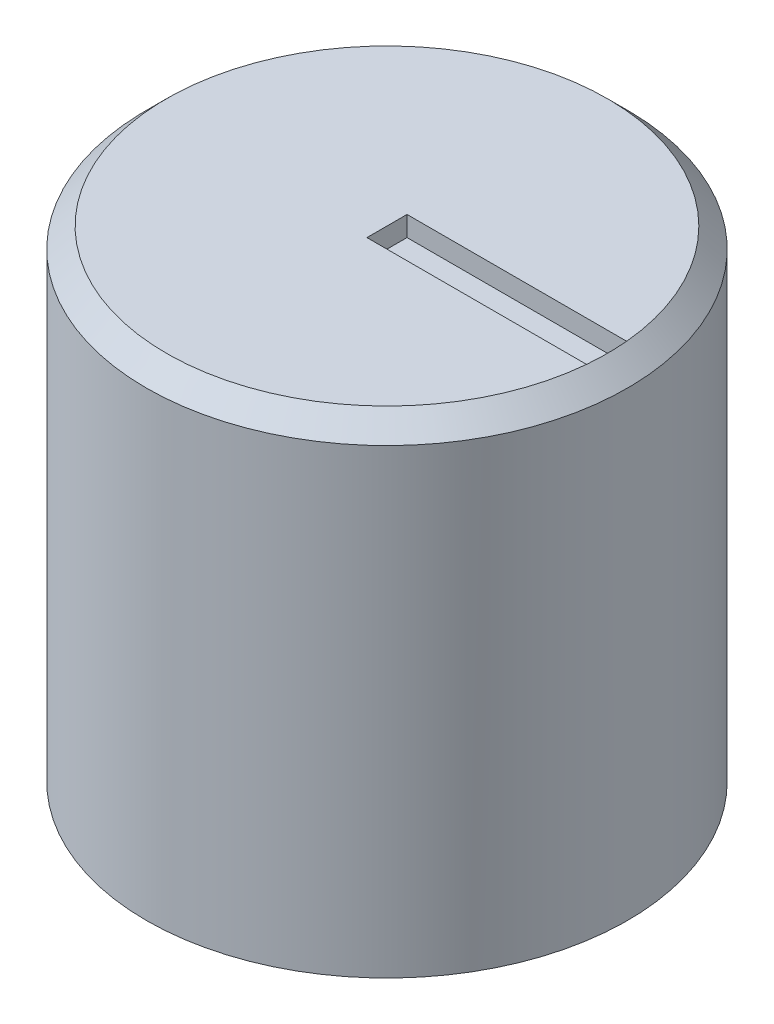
ISO-10303-21;
HEADER;
FILE_DESCRIPTION(('STEP AP214'),'2;1');
FILE_NAME('part.step','',(''),(''),'','','');
FILE_SCHEMA(('AUTOMOTIVE_DESIGN { 1 0 10303 214 1 1 1 1 }'));
ENDSEC;
DATA;
#1=APPLICATION_CONTEXT('core data for automotive mechanical design processes');
#2=APPLICATION_PROTOCOL_DEFINITION('international standard','automotive_design',2000,#1);
#3=PRODUCT_CONTEXT('',#1,'mechanical');
#4=PRODUCT('Part','Part','',(#3));
#5=PRODUCT_RELATED_PRODUCT_CATEGORY('part','',(#4));
#6=PRODUCT_DEFINITION_FORMATION('','',#4);
#7=PRODUCT_DEFINITION_CONTEXT('part definition',#1,'design');
#8=PRODUCT_DEFINITION('design','',#6,#7);
#9=PRODUCT_DEFINITION_SHAPE('','',#8);
#10=(LENGTH_UNIT() NAMED_UNIT(*) SI_UNIT(.MILLI.,.METRE.));
#11=(NAMED_UNIT(*) PLANE_ANGLE_UNIT() SI_UNIT($,.RADIAN.));
#12=(NAMED_UNIT(*) SI_UNIT($,.STERADIAN.) SOLID_ANGLE_UNIT());
#13=UNCERTAINTY_MEASURE_WITH_UNIT(LENGTH_MEASURE(1.E-05),#10,'distance_accuracy_value','');
#14=(GEOMETRIC_REPRESENTATION_CONTEXT(3) GLOBAL_UNCERTAINTY_ASSIGNED_CONTEXT((#13)) GLOBAL_UNIT_ASSIGNED_CONTEXT((#10,
#11,#12)) REPRESENTATION_CONTEXT('',''));
#15=CARTESIAN_POINT('',(0.,0.,0.));
#16=DIRECTION('',(0.,0.,1.));
#17=DIRECTION('',(1.,0.,0.));
#18=AXIS2_PLACEMENT_3D('',#15,#16,#17);
#19=CARTESIAN_POINT('',(0.,12.,0.));
#20=DIRECTION('',(0.,-1.,0.));
#21=DIRECTION('',(0.,0.,-1.));
#22=AXIS2_PLACEMENT_3D('',#19,#20,#21);
#23=CYLINDRICAL_SURFACE('',#22,6.);
#24=CARTESIAN_POINT('',(0.,11.5,0.));
#25=DIRECTION('',(0.,1.,0.));
#26=DIRECTION('',(0.,0.,1.));
#27=AXIS2_PLACEMENT_3D('',#24,#25,#26);
#28=CIRCLE('',#27,6.);
#29=CARTESIAN_POINT('',(0.,11.5,6.));
#30=VERTEX_POINT('',#29);
#31=EDGE_CURVE('E12',#30,#30,#28,.F.);
#32=ORIENTED_EDGE('',*,*,#31,.T.);
#33=EDGE_LOOP('',(#32));
#34=FACE_BOUND('',#33,.T.);
#35=CARTESIAN_POINT('',(0.,0.,0.));
#36=DIRECTION('',(0.,1.,0.));
#37=DIRECTION('',(0.,0.,1.));
#38=AXIS2_PLACEMENT_3D('',#35,#36,#37);
#39=CIRCLE('',#38,6.);
#40=CARTESIAN_POINT('',(0.,0.,6.));
#41=VERTEX_POINT('',#40);
#42=EDGE_CURVE('E122',#41,#41,#39,.T.);
#43=ORIENTED_EDGE('',*,*,#42,.T.);
#44=EDGE_LOOP('',(#43));
#45=FACE_BOUND('',#44,.T.);
#46=ADVANCED_FACE('F38',(#34,#45),#23,.T.);
#47=CARTESIAN_POINT('',(0.,12.,0.));
#48=DIRECTION('',(0.,1.,0.));
#49=DIRECTION('',(0.,0.,1.));
#50=AXIS2_PLACEMENT_3D('',#47,#48,#49);
#51=PLANE('',#50);
#52=DIRECTION('',(-1.,0.,0.));
#53=VECTOR('',#52,1.);
#54=CARTESIAN_POINT('',(0.,12.,-0.5));
#55=LINE('',#54,#53);
#56=CARTESIAN_POINT('',(5.47722557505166,12.,-0.5));
#57=VERTEX_POINT('',#56);
#58=CARTESIAN_POINT('',(0.,12.,-0.5));
#59=VERTEX_POINT('',#58);
#60=EDGE_CURVE('E102',#57,#59,#55,.T.);
#61=ORIENTED_EDGE('',*,*,#60,.F.);
#62=CARTESIAN_POINT('',(0.,12.,0.));
#63=DIRECTION('',(0.,1.,0.));
#64=DIRECTION('',(0.,0.,1.));
#65=AXIS2_PLACEMENT_3D('',#62,#63,#64);
#66=CIRCLE('',#65,5.5);
#67=CARTESIAN_POINT('',(5.47722557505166,12.,0.5));
#68=VERTEX_POINT('',#67);
#69=EDGE_CURVE('E133',#57,#68,#66,.T.);
#70=ORIENTED_EDGE('',*,*,#69,.T.);
#71=DIRECTION('',(1.,0.,0.));
#72=VECTOR('',#71,1.);
#73=CARTESIAN_POINT('',(0.,12.,0.5));
#74=LINE('',#73,#72);
#75=CARTESIAN_POINT('',(0.,12.,0.5));
#76=VERTEX_POINT('',#75);
#77=EDGE_CURVE('E53',#76,#68,#74,.T.);
#78=ORIENTED_EDGE('',*,*,#77,.F.);
#79=DIRECTION('',(0.,0.,1.));
#80=VECTOR('',#79,1.);
#81=CARTESIAN_POINT('',(0.,12.,-0.5));
#82=LINE('',#81,#80);
#83=EDGE_CURVE('E106',#59,#76,#82,.T.);
#84=ORIENTED_EDGE('',*,*,#83,.F.);
#85=EDGE_LOOP('',(#61,#70,#78,#84));
#86=FACE_BOUND('',#85,.T.);
#87=ADVANCED_FACE('F138',(#86),#51,.T.);
#88=CARTESIAN_POINT('',(0.,0.,0.));
#89=DIRECTION('',(0.,1.,0.));
#90=DIRECTION('',(0.,0.,1.));
#91=AXIS2_PLACEMENT_3D('',#88,#89,#90);
#92=PLANE('',#91);
#93=CARTESIAN_POINT('',(0.,0.,0.));
#94=DIRECTION('',(0.,-1.,0.));
#95=DIRECTION('',(0.,0.,-1.));
#96=AXIS2_PLACEMENT_3D('',#93,#94,#95);
#97=CIRCLE('',#96,5.5);
#98=CARTESIAN_POINT('',(0.,0.,-5.5));
#99=VERTEX_POINT('',#98);
#100=EDGE_CURVE('E119',#99,#99,#97,.T.);
#101=ORIENTED_EDGE('',*,*,#100,.F.);
#102=EDGE_LOOP('',(#101));
#103=FACE_BOUND('',#102,.T.);
#104=ORIENTED_EDGE('',*,*,#42,.F.);
#105=EDGE_LOOP('',(#104));
#106=FACE_BOUND('',#105,.T.);
#107=ADVANCED_FACE('F160',(#103,#106),#92,.F.);
#108=CARTESIAN_POINT('',(0.,10.5,0.));
#109=DIRECTION('',(0.,-1.,0.));
#110=DIRECTION('',(0.,0.,-1.));
#111=AXIS2_PLACEMENT_3D('',#108,#109,#110);
#112=CYLINDRICAL_SURFACE('',#111,5.5);
#113=CARTESIAN_POINT('',(0.,8.49999999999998,0.));
#114=DIRECTION('',(0.,-1.,0.));
#115=DIRECTION('',(0.,0.,-1.));
#116=AXIS2_PLACEMENT_3D('',#113,#114,#115);
#117=CIRCLE('',#116,5.5);
#118=CARTESIAN_POINT('',(0.,8.49999999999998,-5.5));
#119=VERTEX_POINT('',#118);
#120=EDGE_CURVE('E131',#119,#119,#117,.F.);
#121=CARTESIAN_POINT('',(0.,8.49999999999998,-5.5));
#122=CARTESIAN_POINT('',(0.,8.41145833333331,-5.5));
#123=CARTESIAN_POINT('',(0.,8.32291666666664,-5.5));
#124=CARTESIAN_POINT('',(0.,8.14583333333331,-5.5));
#125=CARTESIAN_POINT('',(0.,8.05729166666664,-5.5));
#126=CARTESIAN_POINT('',(0.,7.88020833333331,-5.5));
#127=CARTESIAN_POINT('',(0.,7.79166666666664,-5.5));
#128=CARTESIAN_POINT('',(0.,7.61458333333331,-5.5));
#129=CARTESIAN_POINT('',(0.,7.52604166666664,-5.5));
#130=CARTESIAN_POINT('',(0.,7.34895833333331,-5.5));
#131=CARTESIAN_POINT('',(0.,7.26041666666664,-5.5));
#132=CARTESIAN_POINT('',(0.,7.08333333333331,-5.5));
#133=CARTESIAN_POINT('',(0.,6.99479166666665,-5.5));
#134=CARTESIAN_POINT('',(0.,6.81770833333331,-5.5));
#135=CARTESIAN_POINT('',(0.,6.72916666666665,-5.5));
#136=CARTESIAN_POINT('',(0.,6.55208333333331,-5.5));
#137=CARTESIAN_POINT('',(0.,6.46354166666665,-5.5));
#138=CARTESIAN_POINT('',(0.,6.28645833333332,-5.5));
#139=CARTESIAN_POINT('',(0.,6.19791666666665,-5.5));
#140=CARTESIAN_POINT('',(0.,6.02083333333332,-5.5));
#141=CARTESIAN_POINT('',(0.,5.93229166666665,-5.5));
#142=CARTESIAN_POINT('',(0.,5.75520833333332,-5.5));
#143=CARTESIAN_POINT('',(0.,5.66666666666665,-5.5));
#144=CARTESIAN_POINT('',(0.,5.48958333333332,-5.5));
#145=CARTESIAN_POINT('',(0.,5.40104166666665,-5.5));
#146=CARTESIAN_POINT('',(0.,5.22395833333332,-5.5));
#147=CARTESIAN_POINT('',(0.,5.13541666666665,-5.5));
#148=CARTESIAN_POINT('',(0.,4.95833333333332,-5.5));
#149=CARTESIAN_POINT('',(0.,4.86979166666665,-5.5));
#150=CARTESIAN_POINT('',(0.,4.69270833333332,-5.5));
#151=CARTESIAN_POINT('',(0.,4.60416666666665,-5.5));
#152=CARTESIAN_POINT('',(0.,4.42708333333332,-5.5));
#153=CARTESIAN_POINT('',(0.,4.33854166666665,-5.5));
#154=CARTESIAN_POINT('',(0.,4.16145833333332,-5.5));
#155=CARTESIAN_POINT('',(0.,4.07291666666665,-5.5));
#156=CARTESIAN_POINT('',(0.,3.89583333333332,-5.5));
#157=CARTESIAN_POINT('',(0.,3.80729166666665,-5.5));
#158=CARTESIAN_POINT('',(0.,3.63020833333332,-5.5));
#159=CARTESIAN_POINT('',(0.,3.54166666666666,-5.5));
#160=CARTESIAN_POINT('',(0.,3.36458333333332,-5.5));
#161=CARTESIAN_POINT('',(0.,3.27604166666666,-5.5));
#162=CARTESIAN_POINT('',(0.,3.09895833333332,-5.5));
#163=CARTESIAN_POINT('',(0.,3.01041666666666,-5.5));
#164=CARTESIAN_POINT('',(0.,2.83333333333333,-5.5));
#165=CARTESIAN_POINT('',(0.,2.74479166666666,-5.5));
#166=CARTESIAN_POINT('',(0.,2.56770833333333,-5.5));
#167=CARTESIAN_POINT('',(0.,2.47916666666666,-5.5));
#168=CARTESIAN_POINT('',(0.,2.30208333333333,-5.5));
#169=CARTESIAN_POINT('',(0.,2.21354166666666,-5.5));
#170=CARTESIAN_POINT('',(0.,2.03645833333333,-5.5));
#171=CARTESIAN_POINT('',(0.,1.94791666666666,-5.5));
#172=CARTESIAN_POINT('',(0.,1.77083333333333,-5.5));
#173=CARTESIAN_POINT('',(0.,1.68229166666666,-5.5));
#174=CARTESIAN_POINT('',(0.,1.50520833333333,-5.5));
#175=CARTESIAN_POINT('',(0.,1.41666666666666,-5.5));
#176=CARTESIAN_POINT('',(0.,1.23958333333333,-5.5));
#177=CARTESIAN_POINT('',(0.,1.15104166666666,-5.5));
#178=CARTESIAN_POINT('',(0.,0.973958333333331,-5.5));
#179=CARTESIAN_POINT('',(0.,0.885416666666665,-5.5));
#180=CARTESIAN_POINT('',(0.,0.708333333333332,-5.5));
#181=CARTESIAN_POINT('',(0.,0.619791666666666,-5.5));
#182=CARTESIAN_POINT('',(0.,0.442708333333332,-5.5));
#183=CARTESIAN_POINT('',(0.,0.354166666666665,-5.5));
#184=CARTESIAN_POINT('',(0.,0.177083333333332,-5.5));
#185=CARTESIAN_POINT('',(0.,0.0885416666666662,-5.5));
#186=CARTESIAN_POINT('',(0.,0.,-5.5));
#187=B_SPLINE_CURVE_WITH_KNOTS('',3,(#121,#122,#123,#124,#125,#126,#127,#128,#129,#130,#131,
#132,#133,#134,#135,#136,#137,#138,#139,#140,#141,#142,#143,#144,#145,#146,#147,#148,#149,#150,
#151,#152,#153,#154,#155,#156,#157,#158,#159,#160,#161,#162,#163,#164,#165,#166,#167,#168,#169,
#170,#171,#172,#173,#174,#175,#176,#177,#178,#179,#180,#181,#182,#183,#184,#185,#186),
.UNSPECIFIED.,.F.,.F.,(4,2,2,2,2,2,2,2,2,2,2,2,2,2,2,2,2,2,2,2,2,2,2,2,2,2,2,2,2,2,2,2,4),(0.,
0.265624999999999,0.531249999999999,0.796874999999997,1.0625,1.328125,1.59374999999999,
1.85937499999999,2.12499999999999,2.39062499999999,2.65624999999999,2.92187499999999,
3.18749999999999,3.45312499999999,3.71874999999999,3.98437499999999,4.24999999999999,
4.51562499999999,4.78124999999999,5.04687499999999,5.31249999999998,5.57812499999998,
5.84374999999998,6.10937499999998,6.37499999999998,6.64062499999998,6.90624999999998,
7.17187499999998,7.43749999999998,7.70312499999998,7.96874999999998,8.23437499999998,
8.49999999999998),.UNSPECIFIED.);
#188=EDGE_CURVE('BSEAM165',#119,#99,#187,.T.);
#189=ORIENTED_EDGE('',*,*,#120,.T.);
#190=ORIENTED_EDGE('',*,*,#100,.T.);
#191=ORIENTED_EDGE('',*,*,#188,.T.);
#192=ORIENTED_EDGE('',*,*,#188,.F.);
#193=EDGE_LOOP('',(#189,#191,#190,#192));
#194=FACE_BOUND('',#193,.T.);
#195=ADVANCED_FACE('F165',(#194),#112,.F.);
#196=CARTESIAN_POINT('',(0.,-11.3137084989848,0.));
#197=DIRECTION('',(0.,1.,0.));
#198=DIRECTION('',(0.,0.,1.));
#199=AXIS2_PLACEMENT_3D('',#196,#197,#198);
#200=CYLINDRICAL_SURFACE('',#199,4.);
#201=CARTESIAN_POINT('',(0.,9.36602540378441,0.));
#202=DIRECTION('',(0.,-1.,0.));
#203=DIRECTION('',(0.,0.,-1.));
#204=AXIS2_PLACEMENT_3D('',#201,#202,#203);
#205=CIRCLE('',#204,4.);
#206=CARTESIAN_POINT('',(0.,9.36602540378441,-4.));
#207=VERTEX_POINT('',#206);
#208=EDGE_CURVE('E128',#207,#207,#205,.T.);
#209=ORIENTED_EDGE('',*,*,#208,.T.);
#210=EDGE_LOOP('',(#209));
#211=FACE_BOUND('',#210,.T.);
#212=CARTESIAN_POINT('',(0.,2.5,0.));
#213=DIRECTION('',(0.,1.,0.));
#214=DIRECTION('',(0.,0.,1.));
#215=AXIS2_PLACEMENT_3D('',#212,#213,#214);
#216=CIRCLE('',#215,4.);
#217=CARTESIAN_POINT('',(0.,2.5,4.));
#218=VERTEX_POINT('',#217);
#219=EDGE_CURVE('E111',#218,#218,#216,.T.);
#220=ORIENTED_EDGE('',*,*,#219,.T.);
#221=EDGE_LOOP('',(#220));
#222=FACE_BOUND('',#221,.T.);
#223=ADVANCED_FACE('F170',(#211,#222),#200,.T.);
#224=CARTESIAN_POINT('',(0.,-11.3137084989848,0.));
#225=DIRECTION('',(0.,1.,0.));
#226=DIRECTION('',(0.,0.,1.));
#227=AXIS2_PLACEMENT_3D('',#224,#225,#226);
#228=CYLINDRICAL_SURFACE('',#227,3.);
#229=CARTESIAN_POINT('',(0.,2.5,0.));
#230=DIRECTION('',(0.,1.,0.));
#231=DIRECTION('',(0.,0.,1.));
#232=AXIS2_PLACEMENT_3D('',#229,#230,#231);
#233=CIRCLE('',#232,3.);
#234=CARTESIAN_POINT('',(0.,2.5,3.));
#235=VERTEX_POINT('',#234);
#236=EDGE_CURVE('E116',#235,#235,#233,.T.);
#237=ORIENTED_EDGE('',*,*,#236,.F.);
#238=EDGE_LOOP('',(#237));
#239=FACE_BOUND('',#238,.T.);
#240=CARTESIAN_POINT('',(0.,10.5,0.));
#241=DIRECTION('',(0.,-1.,0.));
#242=DIRECTION('',(0.,0.,-1.));
#243=AXIS2_PLACEMENT_3D('',#240,#241,#242);
#244=CIRCLE('',#243,3.);
#245=CARTESIAN_POINT('',(0.,10.5,-3.));
#246=VERTEX_POINT('',#245);
#247=EDGE_CURVE('E125',#246,#246,#244,.F.);
#248=ORIENTED_EDGE('',*,*,#247,.T.);
#249=EDGE_LOOP('',(#248));
#250=FACE_BOUND('',#249,.T.);
#251=ADVANCED_FACE('F178',(#239,#250),#228,.F.);
#252=CARTESIAN_POINT('',(0.,2.5,0.));
#253=DIRECTION('',(0.,1.,0.));
#254=DIRECTION('',(0.,0.,1.));
#255=AXIS2_PLACEMENT_3D('',#252,#253,#254);
#256=PLANE('',#255);
#257=ORIENTED_EDGE('',*,*,#236,.T.);
#258=EDGE_LOOP('',(#257));
#259=FACE_BOUND('',#258,.T.);
#260=ORIENTED_EDGE('',*,*,#219,.F.);
#261=EDGE_LOOP('',(#260));
#262=FACE_BOUND('',#261,.T.);
#263=ADVANCED_FACE('F174',(#259,#262),#256,.F.);
#264=CARTESIAN_POINT('',(0.,10.5,0.));
#265=DIRECTION('',(0.,-1.,0.));
#266=DIRECTION('',(0.,0.,-1.));
#267=AXIS2_PLACEMENT_3D('',#264,#265,#266);
#268=PLANE('',#267);
#269=ORIENTED_EDGE('',*,*,#247,.F.);
#270=EDGE_LOOP('',(#269));
#271=FACE_BOUND('',#270,.T.);
#272=ADVANCED_FACE('F151',(#271),#268,.T.);
#273=CARTESIAN_POINT('',(0.,10.5,0.));
#274=DIRECTION('',(0.,-1.,0.));
#275=DIRECTION('',(0.,0.,-1.));
#276=AXIS2_PLACEMENT_3D('',#273,#274,#275);
#277=CONICAL_SURFACE('',#276,2.03589838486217,1.0471975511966);
#278=ORIENTED_EDGE('',*,*,#120,.F.);
#279=EDGE_LOOP('',(#278));
#280=FACE_BOUND('',#279,.T.);
#281=ORIENTED_EDGE('',*,*,#208,.F.);
#282=EDGE_LOOP('',(#281));
#283=FACE_BOUND('',#282,.T.);
#284=ADVANCED_FACE('F143',(#280,#283),#277,.F.);
#285=CARTESIAN_POINT('',(0.,12.,0.));
#286=DIRECTION('',(0.,-1.,0.));
#287=DIRECTION('',(0.,0.,-1.));
#288=AXIS2_PLACEMENT_3D('',#285,#286,#287);
#289=CONICAL_SURFACE('',#288,5.5,0.785398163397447);
#290=ORIENTED_EDGE('',*,*,#31,.F.);
#291=EDGE_LOOP('',(#290));
#292=FACE_BOUND('',#291,.T.);
#293=EDGE_CURVE('E46',#68,#57,#66,.T.);
#294=ORIENTED_EDGE('',*,*,#293,.F.);
#295=ORIENTED_EDGE('',*,*,#69,.F.);
#296=EDGE_LOOP('',(#294,#295));
#297=FACE_BOUND('',#296,.T.);
#298=ADVANCED_FACE('F40',(#292,#297),#289,.T.);
#299=CARTESIAN_POINT('',(0.,11.5,-0.5));
#300=DIRECTION('',(-1.,0.,0.));
#301=DIRECTION('',(0.,0.,1.));
#302=AXIS2_PLACEMENT_3D('',#299,#300,#301);
#303=PLANE('',#302);
#304=ORIENTED_EDGE('',*,*,#83,.T.);
#305=DIRECTION('',(0.,1.,0.));
#306=VECTOR('',#305,1.);
#307=CARTESIAN_POINT('',(0.,11.5,0.5));
#308=LINE('',#307,#306);
#309=CARTESIAN_POINT('',(0.,11.5,0.5));
#310=VERTEX_POINT('',#309);
#311=EDGE_CURVE('E79',#310,#76,#308,.T.);
#312=ORIENTED_EDGE('',*,*,#311,.F.);
#313=DIRECTION('',(0.,0.,1.));
#314=VECTOR('',#313,1.);
#315=CARTESIAN_POINT('',(0.,11.5,-0.5));
#316=LINE('',#315,#314);
#317=CARTESIAN_POINT('',(0.,11.5,-0.5));
#318=VERTEX_POINT('',#317);
#319=EDGE_CURVE('E100',#318,#310,#316,.T.);
#320=ORIENTED_EDGE('',*,*,#319,.F.);
#321=DIRECTION('',(0.,1.,0.));
#322=VECTOR('',#321,1.);
#323=CARTESIAN_POINT('',(0.,11.5,-0.5));
#324=LINE('',#323,#322);
#325=EDGE_CURVE('E62',#318,#59,#324,.T.);
#326=ORIENTED_EDGE('',*,*,#325,.T.);
#327=EDGE_LOOP('',(#304,#312,#320,#326));
#328=FACE_BOUND('',#327,.T.);
#329=ADVANCED_FACE('F142',(#328),#303,.F.);
#330=CARTESIAN_POINT('',(0.,11.5,-0.5));
#331=DIRECTION('',(0.,0.,-1.));
#332=DIRECTION('',(-1.,0.,0.));
#333=AXIS2_PLACEMENT_3D('',#330,#331,#332);
#334=PLANE('',#333);
#335=ORIENTED_EDGE('',*,*,#60,.T.);
#336=ORIENTED_EDGE('',*,*,#325,.F.);
#337=DIRECTION('',(-1.,0.,0.));
#338=VECTOR('',#337,1.);
#339=CARTESIAN_POINT('',(0.,11.5,-0.5));
#340=LINE('',#339,#338);
#341=CARTESIAN_POINT('',(5.47722557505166,11.5,-0.5));
#342=VERTEX_POINT('',#341);
#343=EDGE_CURVE('E97',#342,#318,#340,.T.);
#344=ORIENTED_EDGE('',*,*,#343,.F.);
#345=DIRECTION('',(0.,1.,0.));
#346=VECTOR('',#345,1.);
#347=CARTESIAN_POINT('',(5.47722557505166,11.5,-0.5));
#348=LINE('',#347,#346);
#349=EDGE_CURVE('E90',#342,#57,#348,.T.);
#350=ORIENTED_EDGE('',*,*,#349,.T.);
#351=EDGE_LOOP('',(#335,#336,#344,#350));
#352=FACE_BOUND('',#351,.T.);
#353=ADVANCED_FACE('F149',(#352),#334,.F.);
#354=CARTESIAN_POINT('',(0.,11.5,0.));
#355=DIRECTION('',(0.,1.,0.));
#356=DIRECTION('',(0.,0.,1.));
#357=AXIS2_PLACEMENT_3D('',#354,#355,#356);
#358=CYLINDRICAL_SURFACE('',#357,5.5);
#359=ORIENTED_EDGE('',*,*,#293,.T.);
#360=ORIENTED_EDGE('',*,*,#349,.F.);
#361=CARTESIAN_POINT('',(0.,11.5,0.));
#362=DIRECTION('',(0.,1.,0.));
#363=DIRECTION('',(0.,0.,1.));
#364=AXIS2_PLACEMENT_3D('',#361,#362,#363);
#365=CIRCLE('',#364,5.5);
#366=CARTESIAN_POINT('',(5.47722557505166,11.5,0.5));
#367=VERTEX_POINT('',#366);
#368=EDGE_CURVE('E93',#367,#342,#365,.T.);
#369=ORIENTED_EDGE('',*,*,#368,.F.);
#370=DIRECTION('',(0.,1.,0.));
#371=VECTOR('',#370,1.);
#372=CARTESIAN_POINT('',(5.47722557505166,11.5,0.5));
#373=LINE('',#372,#371);
#374=EDGE_CURVE('E81',#367,#68,#373,.T.);
#375=ORIENTED_EDGE('',*,*,#374,.T.);
#376=EDGE_LOOP('',(#359,#360,#369,#375));
#377=FACE_BOUND('',#376,.T.);
#378=ADVANCED_FACE('F94',(#377),#358,.F.);
#379=CARTESIAN_POINT('',(0.,11.5,0.5));
#380=DIRECTION('',(0.,0.,1.));
#381=DIRECTION('',(1.,0.,0.));
#382=AXIS2_PLACEMENT_3D('',#379,#380,#381);
#383=PLANE('',#382);
#384=ORIENTED_EDGE('',*,*,#77,.T.);
#385=ORIENTED_EDGE('',*,*,#374,.F.);
#386=DIRECTION('',(1.,0.,0.));
#387=VECTOR('',#386,1.);
#388=CARTESIAN_POINT('',(0.,11.5,0.5));
#389=LINE('',#388,#387);
#390=EDGE_CURVE('E85',#310,#367,#389,.T.);
#391=ORIENTED_EDGE('',*,*,#390,.F.);
#392=ORIENTED_EDGE('',*,*,#311,.T.);
#393=EDGE_LOOP('',(#384,#385,#391,#392));
#394=FACE_BOUND('',#393,.T.);
#395=ADVANCED_FACE('F83',(#394),#383,.F.);
#396=CARTESIAN_POINT('',(0.,11.5,0.));
#397=DIRECTION('',(0.,1.,0.));
#398=DIRECTION('',(0.,0.,1.));
#399=AXIS2_PLACEMENT_3D('',#396,#397,#398);
#400=PLANE('',#399);
#401=ORIENTED_EDGE('',*,*,#319,.T.);
#402=ORIENTED_EDGE('',*,*,#390,.T.);
#403=ORIENTED_EDGE('',*,*,#368,.T.);
#404=ORIENTED_EDGE('',*,*,#343,.T.);
#405=EDGE_LOOP('',(#401,#402,#403,#404));
#406=FACE_BOUND('',#405,.T.);
#407=ADVANCED_FACE('F99',(#406),#400,.T.);
#408=CLOSED_SHELL('',(#46,#87,#107,#195,#223,#251,#263,#272,#284,#298,#329,#353,#378,#395,#407));
#409=MANIFOLD_SOLID_BREP('B2',#408);
#410=ADVANCED_BREP_SHAPE_REPRESENTATION('',(#18,#409),#14);
#411=SHAPE_DEFINITION_REPRESENTATION(#9,#410);
ENDSEC;
END-ISO-10303-21;
